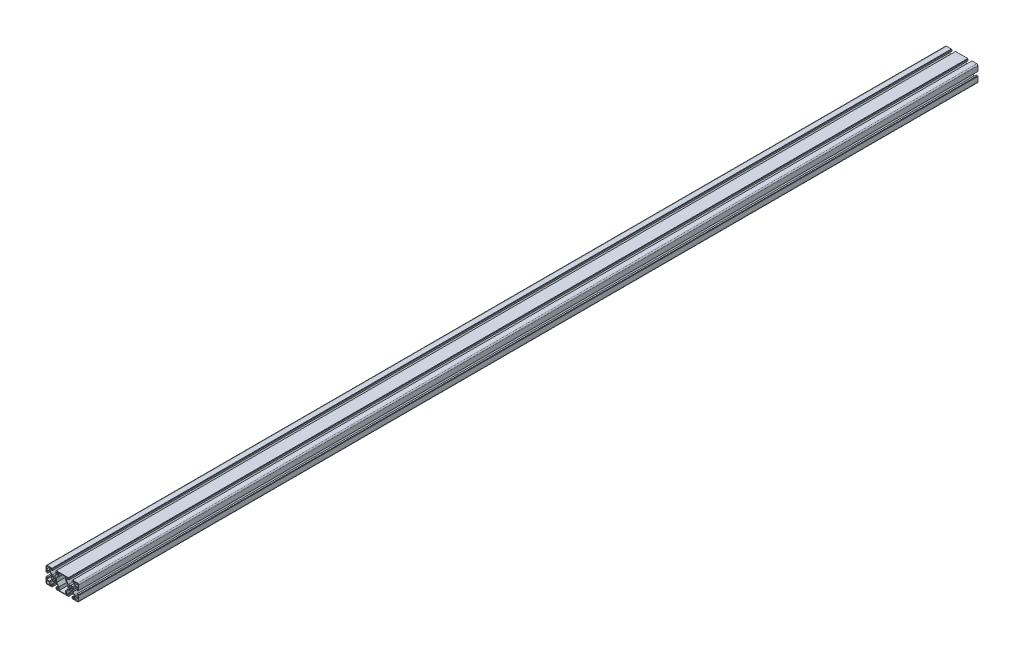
from build123d import *

# Parameters (mm, degrees)
EXTRUDE_1_DEPTH                  = 2200
HOLE_WIZARD_8_2_8_2_1_AT_2_COUNT = 2
HOLE_WIZARD_8_2_8_2_1_AT_2_PITCH = 130
HOLE_WIZARD_8_2_8_2_1_AT_3_COUNT = 2
HOLE_WIZARD_8_2_8_2_1_AT_3_PITCH = 150
HOLE_WIZARD_8_2_8_2_1_AT_4_COUNT = 2
HOLE_WIZARD_8_2_8_2_1_AT_4_PITCH = 280
HOLE_WIZARD_8_2_8_2_1_AT_5_COUNT = 2
HOLE_WIZARD_8_2_8_2_1_AT_5_PITCH = 300
HOLE_WIZARD_8_2_8_2_1_AT_6_COUNT = 2
HOLE_WIZARD_8_2_8_2_1_AT_6_PITCH = 430


with BuildPart() as part:
    # Sketch 1 → Extrude 1 (new body)
    with BuildSketch(Plane.XY):
        with BuildLine():
            Line((36.868070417, -20.92350708), (24.968070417, -20.92350708))
            Line((24.968070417, -20.92350708), (24.968070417, -19.92350708))
            Line((24.968070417, -19.92350708), (23.968070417, -19.92350708))
            Line((23.968070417, -19.92350708), (23.968070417, -16.52350708))
            Line((23.968070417, -16.52350708), (26.268070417, -16.52350708))
            Line((26.268070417, -16.52350708), (26.268070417, -19.22350708))
            Line((26.268070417, -19.22350708), (30.113124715, -19.22350708))
            Line((30.113124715, -19.22350708), (30.113124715, -12.445982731))
            Line((30.113124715, -12.445982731), (24.590015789, -6.92744624))
            Line((24.590015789, -6.92744624), (20.358734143, -6.92744624))
            Line((20.358734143, -6.92744624), (19.860150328, -6.428862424))
            Line((19.860150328, -6.428862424), (19.361566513, -6.92744624))
            Line((19.361566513, -6.92744624), (15.130284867, -6.92744624))
            Line((15.130284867, -6.92744624), (9.618070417, -12.42018438))
            Line((9.618070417, -12.42018438), (9.618070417, -19.22350708))
            Line((9.618070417, -19.22350708), (13.468070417, -19.22350708))
            Line((13.468070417, -19.22350708), (13.468070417, -16.52350708))
            Line((13.468070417, -16.52350708), (15.768070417, -16.52350708))
            Line((15.768070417, -16.52350708), (15.768070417, -19.92350708))
            Line((15.768070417, -19.92350708), (14.768070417, -19.92350708))
            Line((14.768070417, -19.92350708), (14.768070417, -20.92350708))
            Line((14.768070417, -20.92350708), (-15.031929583, -20.92350708))
            Line((-15.031929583, -20.92350708), (-15.031929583, -19.92350708))
            Line((-15.031929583, -19.92350708), (-16.031929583, -19.92350708))
            Line((-16.031929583, -19.92350708), (-16.031929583, -16.52350708))
            Line((-16.031929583, -16.52350708), (-13.731929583, -16.52350708))
            Line((-13.731929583, -16.52350708), (-13.731929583, -19.22350708))
            Line((-13.731929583, -19.22350708), (-9.886875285, -19.22350708))
            Line((-9.886875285, -19.22350708), (-9.886875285, -12.445982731))
            Line((-9.886875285, -12.445982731), (-15.409984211, -6.92744624))
            Line((-15.409984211, -6.92744624), (-19.641265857, -6.92744624))
            Line((-19.641265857, -6.92744624), (-20.139849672, -6.428862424))
            Line((-20.139849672, -6.428862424), (-20.638433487, -6.927446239))
            Line((-20.638433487, -6.927446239), (-24.869715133, -6.927446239))
            Line((-24.869715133, -6.927446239), (-30.381929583, -12.42018438))
            Line((-30.381929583, -12.42018438), (-30.381929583, -19.22350708))
            Line((-30.381929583, -19.22350708), (-26.531929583, -19.22350708))
            Line((-26.531929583, -19.22350708), (-26.531929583, -16.52350708))
            Line((-26.531929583, -16.52350708), (-24.231929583, -16.52350708))
            Line((-24.231929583, -16.52350708), (-24.231929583, -19.92350708))
            Line((-24.231929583, -19.92350708), (-25.231929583, -19.92350708))
            Line((-25.231929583, -19.92350708), (-25.231929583, -20.92350708))
            Line((-25.231929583, -20.92350708), (-37.131929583, -20.92350708))
            ThreePointArc((-37.131929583, -20.92350708), (-39.253249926, -20.044827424), (-40.131929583, -17.92350708))
            Line((-40.131929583, -17.92350708), (-40.131929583, -6.02350708))
            Line((-40.131929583, -6.02350708), (-39.131929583, -6.02350708))
            Line((-39.131929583, -6.02350708), (-39.131929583, -5.02350708))
            Line((-39.131929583, -5.02350708), (-35.731929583, -5.02350708))
            Line((-35.731929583, -5.02350708), (-35.731929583, -7.32350708))
            Line((-35.731929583, -7.32350708), (-38.431929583, -7.32350708))
            Line((-38.431929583, -7.32350708), (-38.431929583, -11.17350708))
            Line((-38.431929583, -11.17350708), (-31.659413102, -11.17350708))
            Line((-31.659413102, -11.17350708), (-26.131929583, -5.646023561))
            Line((-26.131929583, -5.646023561), (-26.131929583, -1.42845368))
            Line((-26.131929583, -1.42845368), (-25.631026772, -0.927550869))
            Line((-25.631026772, -0.927550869), (-26.131929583, -0.426648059))
            Line((-26.131929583, -0.426648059), (-26.131929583, 3.790921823))
            Line((-26.131929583, 3.790921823), (-31.65878515, 9.317149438))
            Line((-31.65878515, 9.317149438), (-38.431929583, 9.317149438))
            Line((-38.431929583, 9.317149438), (-38.431929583, 5.469118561))
            Line((-38.431929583, 5.469118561), (-35.731929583, 5.469118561))
            Line((-35.731929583, 5.469118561), (-35.731929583, 3.17649292))
            Line((-35.731929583, 3.17649292), (-39.131929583, 3.17649292))
            Line((-39.131929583, 3.17649292), (-39.131929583, 4.17649292))
            Line((-39.131929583, 4.17649292), (-40.131929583, 4.17649292))
            Line((-40.131929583, 4.17649292), (-40.131929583, 16.07649292))
            ThreePointArc((-40.131929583, 16.07649292), (-39.253249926, 18.197813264), (-37.131929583, 19.07649292))
            Line((-37.131929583, 19.07649292), (-25.231929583, 19.07649292))
            Line((-25.231929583, 19.07649292), (-25.231929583, 18.07649292))
            Line((-25.231929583, 18.07649292), (-24.231929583, 18.07649292))
            Line((-24.231929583, 18.07649292), (-24.231929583, 14.67649292))
            Line((-24.231929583, 14.67649292), (-26.531929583, 14.67649292))
            Line((-26.531929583, 14.67649292), (-26.531929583, 17.37649292))
            Line((-26.531929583, 17.37649292), (-30.379958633, 17.37649292))
            Line((-30.379958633, 17.37649292), (-30.379958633, 10.590971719))
            Line((-30.379958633, 10.590971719), (-24.864426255, 5.072553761))
            Line((-24.864426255, 5.072553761), (-20.635100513, 5.072553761))
            Line((-20.635100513, 5.072553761), (-20.139670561, 4.577123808))
            Line((-20.139670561, 4.577123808), (-19.644240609, 5.072553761))
            Line((-19.644240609, 5.072553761), (-15.414914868, 5.072553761))
            Line((-15.414914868, 5.072553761), (-9.883292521, 10.610327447))
            Line((-9.883292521, 10.610327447), (-9.883292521, 17.37649292))
            Line((-9.883292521, 17.37649292), (-13.731929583, 17.37649292))
            Line((-13.731929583, 17.37649292), (-13.731929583, 14.67649292))
            Line((-13.731929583, 14.67649292), (-16.031929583, 14.67649292))
            Line((-16.031929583, 14.67649292), (-16.031929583, 18.07649292))
            Line((-16.031929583, 18.07649292), (-15.031929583, 18.07649292))
            Line((-15.031929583, 18.07649292), (-15.031929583, 19.07649292))
            Line((-15.031929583, 19.07649292), (14.768070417, 19.07649292))
            Line((14.768070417, 19.07649292), (14.768070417, 18.07649292))
            Line((14.768070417, 18.07649292), (15.768070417, 18.07649292))
            Line((15.768070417, 18.07649292), (15.768070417, 14.67649292))
            Line((15.768070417, 14.67649292), (13.468070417, 14.67649292))
            Line((13.468070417, 14.67649292), (13.468070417, 17.37649292))
            Line((13.468070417, 17.37649292), (9.620041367, 17.37649292))
            Line((9.620041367, 17.37649292), (9.620041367, 10.590971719))
            Line((9.620041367, 10.590971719), (15.135573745, 5.072553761))
            Line((15.135573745, 5.072553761), (19.364899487, 5.072553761))
            Line((19.364899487, 5.072553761), (19.860329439, 4.577123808))
            Line((19.860329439, 4.577123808), (20.355759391, 5.072553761))
            Line((20.355759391, 5.072553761), (24.585085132, 5.072553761))
            Line((24.585085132, 5.072553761), (30.116707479, 10.610327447))
            Line((30.116707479, 10.610327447), (30.116707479, 17.37649292))
            Line((30.116707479, 17.37649292), (26.268070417, 17.37649292))
            Line((26.268070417, 17.37649292), (26.268070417, 14.67649292))
            Line((26.268070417, 14.67649292), (23.968070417, 14.67649292))
            Line((23.968070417, 14.67649292), (23.968070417, 18.07649292))
            Line((23.968070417, 18.07649292), (24.968070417, 18.07649292))
            Line((24.968070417, 18.07649292), (24.968070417, 19.07649292))
            Line((24.968070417, 19.07649292), (36.868070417, 19.07649292))
            ThreePointArc((36.868070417, 19.07649292), (38.989390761, 18.197813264), (39.868070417, 16.07649292))
            Line((39.868070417, 16.07649292), (39.868070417, 4.178573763))
            Line((39.868070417, 4.178573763), (38.862826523, 4.178573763))
            Line((38.862826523, 4.178573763), (38.862826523, 3.178573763))
            Line((38.862826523, 3.178573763), (35.462826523, 3.178573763))
            Line((35.462826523, 3.178573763), (35.462826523, 5.478573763))
            Line((35.462826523, 5.478573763), (38.162826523, 5.478573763))
            Line((38.162826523, 5.478573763), (38.162826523, 9.322663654))
            Line((38.162826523, 9.322663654), (31.385278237, 9.322663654))
            Line((31.385278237, 9.322663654), (25.862826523, 3.802611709))
            Line((25.862826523, 3.802611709), (25.862826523, -0.435207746))
            Line((25.862826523, -0.435207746), (25.371619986, -0.926414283))
            Line((25.371619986, -0.926414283), (25.862826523, -1.41762082))
            Line((25.862826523, -1.41762082), (25.862826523, -5.655440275))
            Line((25.862826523, -5.655440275), (31.386433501, -11.179416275))
            Line((31.386433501, -11.179416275), (38.162826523, -11.179416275))
            Line((38.162826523, -11.179416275), (38.162826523, -7.32350708))
            Line((38.162826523, -7.32350708), (35.462826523, -7.32350708))
            Line((35.462826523, -7.32350708), (35.462826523, -5.02350708))
            Line((35.462826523, -5.02350708), (38.862826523, -5.02350708))
            Line((38.862826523, -5.02350708), (38.862826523, -6.02350708))
            Line((38.862826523, -6.02350708), (39.868070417, -6.02350708))
            Line((39.868070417, -6.02350708), (39.868070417, -17.92350708))
            ThreePointArc((39.868070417, -17.92350708), (38.989390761, -20.044827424), (36.868070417, -20.92350708))
        make_face()
        with BuildLine():
            Line((18.28194213, -3.932378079), (17.221009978, -4.993310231))
            ThreePointArc((17.221009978, -4.993310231), (16.867456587, -5.139756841), (16.513903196, -4.993310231))
            Line((16.513903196, -4.993310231), (15.806796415, -4.28620345))
            ThreePointArc((15.806796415, -4.28620345), (15.660349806, -3.93265006), (15.806796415, -3.579096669))
            Line((15.806796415, -3.579096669), (16.867728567, -2.518164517))
            ThreePointArc((16.867728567, -2.518164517), (16.472660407, -0.927446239), (16.867728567, 0.663272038))
            Line((16.867728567, 0.663272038), (15.806796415, 1.72420419))
            ThreePointArc((15.806796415, 1.72420419), (15.660349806, 2.077757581), (15.806796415, 2.431310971))
            Line((15.806796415, 2.431310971), (16.513903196, 3.138417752))
            ThreePointArc((16.513903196, 3.138417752), (16.867456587, 3.284864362), (17.221009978, 3.138417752))
            Line((17.221009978, 3.138417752), (18.28194213, 2.0774856))
            ThreePointArc((18.28194213, 2.0774856), (19.872660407, 2.47255376), (21.463378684, 2.0774856))
            Line((21.463378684, 2.0774856), (22.524310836, 3.138417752))
            ThreePointArc((22.524310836, 3.138417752), (22.877864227, 3.284864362), (23.231417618, 3.138417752))
            Line((23.231417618, 3.138417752), (23.938524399, 2.431310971))
            ThreePointArc((23.938524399, 2.431310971), (24.084971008, 2.07775758), (23.938524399, 1.72420419))
            Line((23.938524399, 1.72420419), (22.877592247, 0.663272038))
            ThreePointArc((22.877592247, 0.663272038), (23.272660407, -0.92744624), (22.877592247, -2.518164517))
            Line((22.877592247, -2.518164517), (23.938524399, -3.579096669))
            ThreePointArc((23.938524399, -3.579096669), (24.084971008, -3.93265006), (23.938524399, -4.28620345))
            Line((23.938524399, -4.28620345), (23.231417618, -4.993310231))
            ThreePointArc((23.231417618, -4.993310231), (22.877864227, -5.139756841), (22.524310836, -4.993310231))
            Line((22.524310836, -4.993310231), (21.463378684, -3.932378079))
            ThreePointArc((21.463378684, -3.932378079), (19.872660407, -4.32744624), (18.28194213, -3.932378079))
        make_face(mode=Mode.SUBTRACT)
        with BuildLine():
            Line((-37.127339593, -19.72350708), (-31.477339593, -19.72350708))
            Line((-31.477339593, -19.72350708), (-31.477339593, -12.27350708))
            Line((-31.477339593, -12.27350708), (-38.927339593, -12.27350708))
            Line((-38.927339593, -12.27350708), (-38.927339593, -17.92350708))
            ThreePointArc((-38.927339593, -17.92350708), (-38.400131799, -19.196299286), (-37.127339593, -19.72350708))
        make_face(mode=Mode.SUBTRACT)
        Polygon((13.832813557, -5.646023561), (7.812340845, -11.666496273), (7.812340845, -19.62350708), (-8.092604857, -19.62350708), (-8.092604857, -11.700377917), (-14.137173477, -5.655440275), (-14.137173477, 3.802611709), (-8.082257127, 9.85512829), (-8.082257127, 17.77649292), (7.821076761, 17.77649292), (7.821076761, 9.802925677), (13.833708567, 3.790921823), align=None, mode=Mode.SUBTRACT)
        with BuildLine():
            Line((-38.927339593, 16.07649292), (-38.927339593, 10.424523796))
            Line((-38.927339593, 10.424523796), (-31.475368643, 10.424523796))
            Line((-31.475368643, 10.424523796), (-31.475368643, 17.87649292))
            Line((-31.475368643, 17.87649292), (-37.127339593, 17.87649292))
            ThreePointArc((-37.127339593, 17.87649292), (-38.400131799, 17.349285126), (-38.927339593, 16.07649292))
        make_face(mode=Mode.SUBTRACT)
        with BuildLine():
            Line((-17.475689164, 3.138417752), (-18.536621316, 2.0774856))
            ThreePointArc((-18.536621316, 2.0774856), (-20.127339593, 2.472553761), (-21.71805787, 2.0774856))
            Line((-21.71805787, 2.0774856), (-22.778990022, 3.138417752))
            ThreePointArc((-22.778990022, 3.138417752), (-23.132543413, 3.284864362), (-23.486096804, 3.138417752))
            Line((-23.486096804, 3.138417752), (-24.193203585, 2.431310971))
            ThreePointArc((-24.193203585, 2.431310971), (-24.339650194, 2.077757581), (-24.193203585, 1.72420419))
            Line((-24.193203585, 1.72420419), (-23.132271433, 0.663272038))
            ThreePointArc((-23.132271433, 0.663272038), (-23.527339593, -0.927446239), (-23.132271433, -2.518164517))
            Line((-23.132271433, -2.518164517), (-24.193203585, -3.579096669))
            ThreePointArc((-24.193203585, -3.579096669), (-24.339650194, -3.932650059), (-24.193203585, -4.28620345))
            Line((-24.193203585, -4.28620345), (-23.486096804, -4.993310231))
            ThreePointArc((-23.486096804, -4.993310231), (-23.132543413, -5.139756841), (-22.778990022, -4.993310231))
            Line((-22.778990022, -4.993310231), (-21.71805787, -3.932378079))
            ThreePointArc((-21.71805787, -3.932378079), (-20.127339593, -4.32744624), (-18.536621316, -3.932378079))
            Line((-18.536621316, -3.932378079), (-17.475689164, -4.993310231))
            ThreePointArc((-17.475689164, -4.993310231), (-17.122135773, -5.139756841), (-16.768582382, -4.993310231))
            Line((-16.768582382, -4.993310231), (-16.061475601, -4.28620345))
            ThreePointArc((-16.061475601, -4.28620345), (-15.915028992, -3.93265006), (-16.061475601, -3.579096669))
            Line((-16.061475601, -3.579096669), (-17.122407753, -2.518164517))
            ThreePointArc((-17.122407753, -2.518164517), (-16.727339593, -0.92744624), (-17.122407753, 0.663272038))
            Line((-17.122407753, 0.663272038), (-16.061475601, 1.72420419))
            ThreePointArc((-16.061475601, 1.72420419), (-15.915028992, 2.07775758), (-16.061475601, 2.431310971))
            Line((-16.061475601, 2.431310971), (-16.768582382, 3.138417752))
            ThreePointArc((-16.768582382, 3.138417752), (-17.122135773, 3.284864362), (-17.475689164, 3.138417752))
        make_face(mode=Mode.SUBTRACT)
        with BuildLine():
            Line((36.872660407, -19.72350708), (31.220689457, -19.72350708))
            Line((31.220689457, -19.72350708), (31.220689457, -12.279416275))
            Line((31.220689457, -12.279416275), (38.672660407, -12.279416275))
            Line((38.672660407, -12.279416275), (38.672660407, -17.92350708))
            ThreePointArc((38.672660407, -17.92350708), (38.145452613, -19.196299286), (36.872660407, -19.72350708))
        make_face(mode=Mode.SUBTRACT)
        with BuildLine():
            Line((38.672660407, 16.07649292), (38.672660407, 10.420582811))
            Line((38.672660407, 10.420582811), (31.224630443, 10.420582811))
            Line((31.224630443, 10.420582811), (31.224630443, 17.87649292))
            Line((31.224630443, 17.87649292), (36.872660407, 17.87649292))
            ThreePointArc((36.872660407, 17.87649292), (38.145452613, 17.349285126), (38.672660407, 16.07649292))
        make_face(mode=Mode.SUBTRACT)
    extrude(amount=EXTRUDE_1_DEPTH)

    # Sketch 3 → Hole Wizard 8.2 _8.2_1 (revolve, cut)
    with BuildSketch(Plane(origin=(-20.139849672, -6.92744624, 2190), x_dir=(0, 0, -1), z_dir=(1, 0, 0))):
        Polygon((0, 0), (0, 28.663528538), (4.1, 26.2), (4.1, 0), align=None)
    hole_wizard_8_2_8_2_1 = revolve(axis=Axis((-20.139849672, -13.27744624, 2190), (0, 1, 0)), mode=Mode.SUBTRACT)

    # Hole Wizard 8.2 _8.2_1 at 2: Hole Wizard 8.2 _8.2_1 ×2
    with Locations(*[(0, 0, -i * HOLE_WIZARD_8_2_8_2_1_AT_2_PITCH) for i in range(1, HOLE_WIZARD_8_2_8_2_1_AT_2_COUNT)]):
        add(hole_wizard_8_2_8_2_1, mode=Mode.SUBTRACT)

    # Hole Wizard 8.2 _8.2_1 at 3: Hole Wizard 8.2 _8.2_1 ×2
    with Locations(*[(0, 0, -i * HOLE_WIZARD_8_2_8_2_1_AT_3_PITCH) for i in range(1, HOLE_WIZARD_8_2_8_2_1_AT_3_COUNT)]):
        add(hole_wizard_8_2_8_2_1, mode=Mode.SUBTRACT)

    # Hole Wizard 8.2 _8.2_1 at 4: Hole Wizard 8.2 _8.2_1 ×2
    with Locations(*[(0, 0, -i * HOLE_WIZARD_8_2_8_2_1_AT_4_PITCH) for i in range(1, HOLE_WIZARD_8_2_8_2_1_AT_4_COUNT)]):
        add(hole_wizard_8_2_8_2_1, mode=Mode.SUBTRACT)

    # Hole Wizard 8.2 _8.2_1 at 5: Hole Wizard 8.2 _8.2_1 ×2
    with Locations(*[(0, 0, -i * HOLE_WIZARD_8_2_8_2_1_AT_5_PITCH) for i in range(1, HOLE_WIZARD_8_2_8_2_1_AT_5_COUNT)]):
        add(hole_wizard_8_2_8_2_1, mode=Mode.SUBTRACT)

    # Hole Wizard 8.2 _8.2_1 at 6: Hole Wizard 8.2 _8.2_1 ×2
    with Locations(*[(0, 0, -i * HOLE_WIZARD_8_2_8_2_1_AT_6_PITCH) for i in range(1, HOLE_WIZARD_8_2_8_2_1_AT_6_COUNT)]):
        add(hole_wizard_8_2_8_2_1, mode=Mode.SUBTRACT)


solid = part.part
